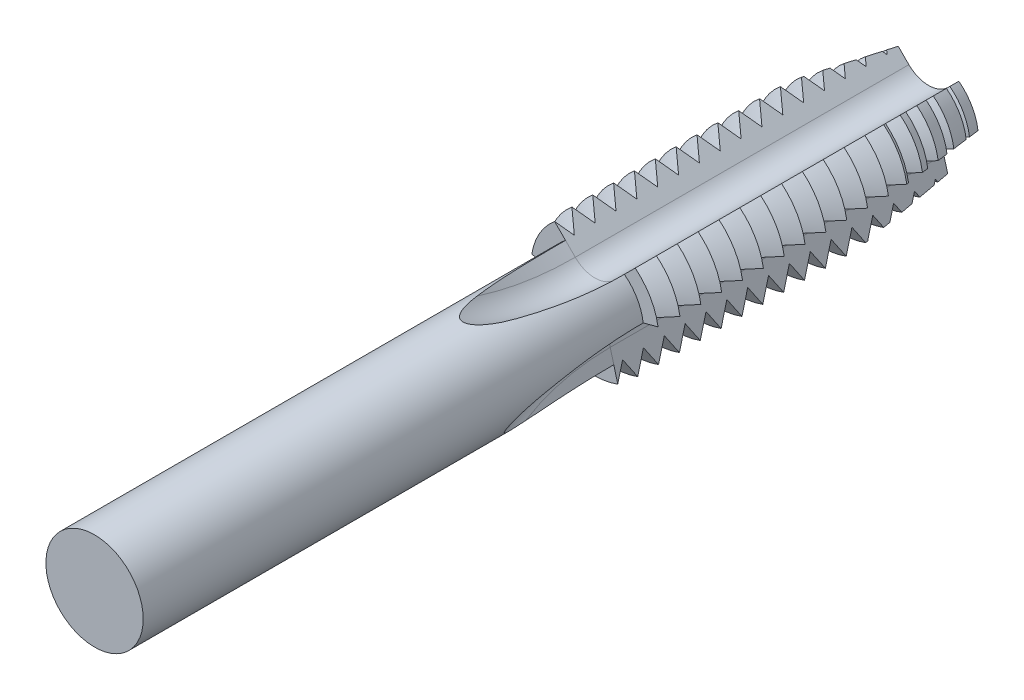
from build123d import *

# Parameters (mm, degrees)
REPDENT_COUNT    = 16
REPDENT_PITCH    = 0.15
REPGOUJURE_COUNT = 3


with BuildPart() as part:
    # EsqCorps → CorpsOutil (revolve)
    with BuildSketch(Plane(origin=(0, 0, 0), x_dir=(0, 0, -1), z_dir=(1, 0, 0)), mode=Mode.PRIVATE) as corpsoutil_sk:
        Polygon((0, 0), (0, 0.358938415), (-0.8, 0.5), (-2.4, 0.5), (-2.4, 0.35), (-6, 0.35), (-6, 0), align=None)
    revolve(corpsoutil_sk.sketch.rotate(Axis((0, 0, 2.948442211), (0, 0, -1)), 90), axis=Axis((0, 0, 2.948442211), (0, 0, -1)))

    # EsqDent → TAGD-Dent (revolve, cut)
    with BuildSketch(Plane(origin=(0, 0, 0), x_dir=(0, 0, -1), z_dir=(1, 0, 0)), mode=Mode.PRIVATE) as tagd_dent_sk:
        Polygon((-0.173205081, 0.5), (-0.08660254, 0.35), (0, 0.5), align=None)
    tagd_dent = revolve(tagd_dent_sk.sketch.rotate(Axis((0, 0, 0.610249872), (0, 0, -1)), 90), axis=Axis((0, 0, 0.610249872), (0, 0, -1)), mode=Mode.SUBTRACT)

    # RepDent: TAGD-Dent ×16
    with Locations(*[(0, 0, i * REPDENT_PITCH) for i in range(1, REPDENT_COUNT)]):
        add(tagd_dent, mode=Mode.SUBTRACT)

    # TAGD-Goujure: sweep along a path in Traj
    with BuildLine(Plane(origin=(0, 0, 0), x_dir=(0, 0, -1), z_dir=(1, 0, 0))) as tagd_goujure_path:
        Line((0, 0), (-2.4, 0))
        ThreePointArc((-2.4, 0), (-4.167766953, 0.732233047), (-4.9, 2.5))
        Line((-4.9, 2.5), (-4.9, 3.239126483))
    # EsqGoujure → TAGD-Goujure (sweep, cut)
    with BuildSketch(Plane.XY):
        with BuildLine():
            Line((0.141421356, 0.208578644), (0.672730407, 0.739887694))
            ThreePointArc((0.672730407, 0.739887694), (0, 1), (-0.672730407, 0.739887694))
            Line((-0.672730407, 0.739887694), (-0.141421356, 0.208578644))
            ThreePointArc((-0.141421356, 0.208578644), (0, 0.15), (0.141421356, 0.208578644))
        make_face()
    tagd_goujure = sweep(path=tagd_goujure_path.line, mode=Mode.SUBTRACT)

    # RepGoujure: TAGD-Goujure ×3 about axis
    repgoujure_axis = Axis((0, 0, 0), (0, 0, 1))
    for i in range(1, REPGOUJURE_COUNT):
        add(tagd_goujure.rotate(repgoujure_axis, i * 360 / REPGOUJURE_COUNT), mode=Mode.SUBTRACT)


solid = part.part
